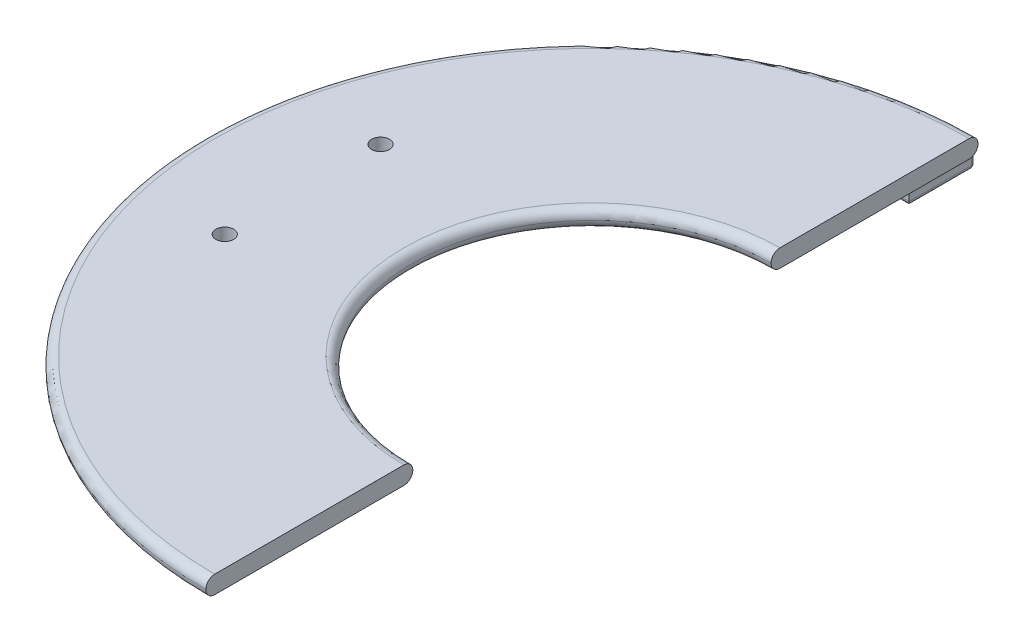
ISO-10303-21;
HEADER;
FILE_DESCRIPTION(('STEP AP214'),'2;1');
FILE_NAME('part.step','',(''),(''),'','','');
FILE_SCHEMA(('AUTOMOTIVE_DESIGN { 1 0 10303 214 1 1 1 1 }'));
ENDSEC;
DATA;
#1=APPLICATION_CONTEXT('core data for automotive mechanical design processes');
#2=APPLICATION_PROTOCOL_DEFINITION('international standard','automotive_design',2000,#1);
#3=PRODUCT_CONTEXT('',#1,'mechanical');
#4=PRODUCT('Part','Part','',(#3));
#5=PRODUCT_RELATED_PRODUCT_CATEGORY('part','',(#4));
#6=PRODUCT_DEFINITION_FORMATION('','',#4);
#7=PRODUCT_DEFINITION_CONTEXT('part definition',#1,'design');
#8=PRODUCT_DEFINITION('design','',#6,#7);
#9=PRODUCT_DEFINITION_SHAPE('','',#8);
#10=(LENGTH_UNIT() NAMED_UNIT(*) SI_UNIT(.MILLI.,.METRE.));
#11=(NAMED_UNIT(*) PLANE_ANGLE_UNIT() SI_UNIT($,.RADIAN.));
#12=(NAMED_UNIT(*) SI_UNIT($,.STERADIAN.) SOLID_ANGLE_UNIT());
#13=UNCERTAINTY_MEASURE_WITH_UNIT(LENGTH_MEASURE(1.E-05),#10,'distance_accuracy_value','');
#14=(GEOMETRIC_REPRESENTATION_CONTEXT(3) GLOBAL_UNCERTAINTY_ASSIGNED_CONTEXT((#13)) GLOBAL_UNIT_ASSIGNED_CONTEXT((#10,
#11,#12)) REPRESENTATION_CONTEXT('',''));
#15=CARTESIAN_POINT('',(0.,0.,0.));
#16=DIRECTION('',(0.,0.,1.));
#17=DIRECTION('',(1.,0.,0.));
#18=AXIS2_PLACEMENT_3D('',#15,#16,#17);
#19=CARTESIAN_POINT('',(-2.49999999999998,-5.,-83.75));
#20=DIRECTION('',(0.,0.,1.));
#21=DIRECTION('',(1.,0.,0.));
#22=AXIS2_PLACEMENT_3D('',#19,#20,#21);
#23=PLANE('',#22);
#24=DIRECTION('',(1.,0.,0.));
#25=VECTOR('',#24,1.);
#26=CARTESIAN_POINT('',(-2.49999999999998,-1.5,-83.75));
#27=LINE('',#26,#25);
#28=CARTESIAN_POINT('',(-13.5,-1.5,-83.75));
#29=VERTEX_POINT('',#28);
#30=CARTESIAN_POINT('',(-3.49999999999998,-1.5,-83.75));
#31=VERTEX_POINT('',#30);
#32=EDGE_CURVE('E188',#29,#31,#27,.T.);
#33=ORIENTED_EDGE('',*,*,#32,.F.);
#34=CARTESIAN_POINT('',(-13.5,-2.5,-83.75));
#35=DIRECTION('',(0.,0.,1.));
#36=DIRECTION('',(1.,0.,0.));
#37=AXIS2_PLACEMENT_3D('',#34,#35,#36);
#38=CIRCLE('',#37,1.);
#39=CARTESIAN_POINT('',(-14.5,-2.5,-83.75));
#40=VERTEX_POINT('',#39);
#41=EDGE_CURVE('E255',#29,#40,#38,.T.);
#42=ORIENTED_EDGE('',*,*,#41,.T.);
#43=DIRECTION('',(0.,1.,0.));
#44=VECTOR('',#43,1.);
#45=CARTESIAN_POINT('',(-14.5,-5.,-83.75));
#46=LINE('',#45,#44);
#47=CARTESIAN_POINT('',(-14.5,0.0151811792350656,-83.75));
#48=VERTEX_POINT('',#47);
#49=EDGE_CURVE('E49',#40,#48,#46,.T.);
#50=ORIENTED_EDGE('',*,*,#49,.T.);
#51=CARTESIAN_POINT('',(-14.5,0.0151811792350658,-83.75));
#52=CARTESIAN_POINT('',(-14.3734136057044,0.0125058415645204,-83.75));
#53=CARTESIAN_POINT('',(-14.2468193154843,0.0102207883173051,-83.75));
#54=CARTESIAN_POINT('',(-13.9936232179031,0.00637405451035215,-83.75));
#55=CARTESIAN_POINT('',(-13.8670214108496,0.00481235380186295,-83.75));
#56=CARTESIAN_POINT('',(-13.6138120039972,0.0023549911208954,-83.75));
#57=CARTESIAN_POINT('',(-13.4872044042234,0.00145932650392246,-83.75));
#58=CARTESIAN_POINT('',(-13.2339827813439,0.000282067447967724,-83.75));
#59=CARTESIAN_POINT('',(-13.1073687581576,4.90112956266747E-07,-83.75));
#60=CARTESIAN_POINT('',(-12.9807549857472,0.,-83.75));
#61=B_SPLINE_CURVE_WITH_KNOTS('',3,(#51,#52,#53,#54,#55,#56,#57,#58,#59,#60),.UNSPECIFIED.,.F.,
.F.,(4,2,2,2,4),(0.,0.379842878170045,0.759675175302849,1.13950596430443,1.51934733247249),.UNSPECIFIED.);
#62=CARTESIAN_POINT('',(-12.9807549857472,0.,-83.75));
#63=VERTEX_POINT('',#62);
#64=EDGE_CURVE('E11',#48,#63,#61,.T.);
#65=ORIENTED_EDGE('',*,*,#64,.T.);
#66=DIRECTION('',(1.,0.,0.));
#67=VECTOR('',#66,1.);
#68=CARTESIAN_POINT('',(-2.49999999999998,0.,-83.75));
#69=LINE('',#68,#67);
#70=CARTESIAN_POINT('',(-2.49999999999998,0.,-83.75));
#71=VERTEX_POINT('',#70);
#72=EDGE_CURVE('E163',#63,#71,#69,.T.);
#73=ORIENTED_EDGE('',*,*,#72,.T.);
#74=DIRECTION('',(0.,1.,0.));
#75=VECTOR('',#74,1.);
#76=CARTESIAN_POINT('',(-2.49999999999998,-5.,-83.75));
#77=LINE('',#76,#75);
#78=CARTESIAN_POINT('',(-2.49999999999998,-2.5,-83.75));
#79=VERTEX_POINT('',#78);
#80=EDGE_CURVE('E166',#79,#71,#77,.T.);
#81=ORIENTED_EDGE('',*,*,#80,.F.);
#82=CARTESIAN_POINT('',(-3.49999999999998,-2.5,-83.75));
#83=DIRECTION('',(0.,0.,1.));
#84=DIRECTION('',(1.,0.,0.));
#85=AXIS2_PLACEMENT_3D('',#82,#83,#84);
#86=CIRCLE('',#85,1.);
#87=EDGE_CURVE('E253',#79,#31,#86,.T.);
#88=ORIENTED_EDGE('',*,*,#87,.T.);
#89=EDGE_LOOP('',(#33,#42,#50,#65,#73,#81,#88));
#90=FACE_BOUND('',#89,.T.);
#91=ADVANCED_FACE('F33',(#90),#23,.F.);
#92=CARTESIAN_POINT('',(0.,0.,0.));
#93=DIRECTION('',(0.,1.,0.));
#94=DIRECTION('',(0.,0.,1.));
#95=AXIS2_PLACEMENT_3D('',#92,#93,#94);
#96=PLANE('',#95);
#97=CARTESIAN_POINT('',(-65.,0.,17.5));
#98=DIRECTION('',(0.,1.,0.));
#99=DIRECTION('',(0.,0.,1.));
#100=AXIS2_PLACEMENT_3D('',#97,#98,#99);
#101=CIRCLE('',#100,2.);
#102=CARTESIAN_POINT('',(-65.,0.,19.5));
#103=VERTEX_POINT('',#102);
#104=EDGE_CURVE('E37',#103,#103,#101,.T.);
#105=ORIENTED_EDGE('',*,*,#104,.T.);
#106=EDGE_LOOP('',(#105));
#107=FACE_BOUND('',#106,.T.);
#108=CARTESIAN_POINT('',(-65.,0.,-17.5));
#109=DIRECTION('',(0.,1.,0.));
#110=DIRECTION('',(0.,0.,1.));
#111=AXIS2_PLACEMENT_3D('',#108,#109,#110);
#112=CIRCLE('',#111,2.);
#113=CARTESIAN_POINT('',(-65.,0.,-15.5));
#114=VERTEX_POINT('',#113);
#115=EDGE_CURVE('E458',#114,#114,#112,.T.);
#116=ORIENTED_EDGE('',*,*,#115,.T.);
#117=EDGE_LOOP('',(#116));
#118=FACE_BOUND('',#117,.T.);
#119=DIRECTION('',(0.,0.,-1.));
#120=VECTOR('',#119,1.);
#121=CARTESIAN_POINT('',(0.,0.,-86.75));
#122=LINE('',#121,#120);
#123=CARTESIAN_POINT('',(0.,0.,-42.25));
#124=VERTEX_POINT('',#123);
#125=CARTESIAN_POINT('',(0.,0.,-84.75));
#126=VERTEX_POINT('',#125);
#127=EDGE_CURVE('E203',#124,#126,#122,.T.);
#128=ORIENTED_EDGE('',*,*,#127,.F.);
#129=CARTESIAN_POINT('',(0.,0.,0.));
#130=DIRECTION('',(0.,1.,0.));
#131=DIRECTION('',(0.,0.,1.));
#132=AXIS2_PLACEMENT_3D('',#129,#130,#131);
#133=CIRCLE('',#132,42.25);
#134=CARTESIAN_POINT('',(0.,0.,42.25));
#135=VERTEX_POINT('',#134);
#136=EDGE_CURVE('E321',#124,#135,#133,.T.);
#137=ORIENTED_EDGE('',*,*,#136,.T.);
#138=DIRECTION('',(0.,0.,-1.));
#139=VECTOR('',#138,1.);
#140=CARTESIAN_POINT('',(0.,0.,40.25));
#141=LINE('',#140,#139);
#142=CARTESIAN_POINT('',(0.,0.,84.75));
#143=VERTEX_POINT('',#142);
#144=EDGE_CURVE('E208',#143,#135,#141,.T.);
#145=ORIENTED_EDGE('',*,*,#144,.F.);
#146=CARTESIAN_POINT('',(0.,0.,0.));
#147=DIRECTION('',(0.,1.,0.));
#148=DIRECTION('',(0.,0.,1.));
#149=AXIS2_PLACEMENT_3D('',#146,#147,#148);
#150=CIRCLE('',#149,84.75);
#151=CARTESIAN_POINT('',(-14.5,0.,-83.5003742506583));
#152=VERTEX_POINT('',#151);
#153=EDGE_CURVE('E319',#143,#152,#150,.F.);
#154=ORIENTED_EDGE('',*,*,#153,.T.);
#155=DIRECTION('',(0.,0.,-1.));
#156=VECTOR('',#155,1.);
#157=CARTESIAN_POINT('',(-14.5,0.,-83.75));
#158=LINE('',#157,#156);
#159=CARTESIAN_POINT('',(-14.5,0.,-73.75));
#160=VERTEX_POINT('',#159);
#161=EDGE_CURVE('E171',#160,#152,#158,.T.);
#162=ORIENTED_EDGE('',*,*,#161,.F.);
#163=DIRECTION('',(-1.,0.,0.));
#164=VECTOR('',#163,1.);
#165=CARTESIAN_POINT('',(-2.49999999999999,0.,-73.75));
#166=LINE('',#165,#164);
#167=CARTESIAN_POINT('',(-2.49999999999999,0.,-73.75));
#168=VERTEX_POINT('',#167);
#169=EDGE_CURVE('E187',#168,#160,#166,.T.);
#170=ORIENTED_EDGE('',*,*,#169,.F.);
#171=DIRECTION('',(0.,0.,1.));
#172=VECTOR('',#171,1.);
#173=CARTESIAN_POINT('',(-2.49999999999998,0.,-83.75));
#174=LINE('',#173,#172);
#175=EDGE_CURVE('E177',#71,#168,#174,.T.);
#176=ORIENTED_EDGE('',*,*,#175,.F.);
#177=ORIENTED_EDGE('',*,*,#72,.F.);
#178=CARTESIAN_POINT('',(0.,0.,0.));
#179=DIRECTION('',(0.,1.,0.));
#180=DIRECTION('',(0.,0.,1.));
#181=AXIS2_PLACEMENT_3D('',#178,#179,#180);
#182=CIRCLE('',#181,84.75);
#183=EDGE_CURVE('E317',#63,#126,#182,.F.);
#184=ORIENTED_EDGE('',*,*,#183,.T.);
#185=EDGE_LOOP('',(#128,#137,#145,#154,#162,#170,#176,#177,#184));
#186=FACE_BOUND('',#185,.T.);
#187=ADVANCED_FACE('F184',(#107,#118,#186),#96,.F.);
#188=CARTESIAN_POINT('',(0.,4.,-86.75));
#189=DIRECTION('',(-1.,0.,0.));
#190=DIRECTION('',(0.,0.,1.));
#191=AXIS2_PLACEMENT_3D('',#188,#189,#190);
#192=PLANE('',#191);
#193=DIRECTION('',(0.,0.,-1.));
#194=VECTOR('',#193,1.);
#195=CARTESIAN_POINT('',(0.,4.,-86.75));
#196=LINE('',#195,#194);
#197=CARTESIAN_POINT('',(0.,4.,-42.25));
#198=VERTEX_POINT('',#197);
#199=CARTESIAN_POINT('',(0.,4.,-84.75));
#200=VERTEX_POINT('',#199);
#201=EDGE_CURVE('E204',#198,#200,#196,.T.);
#202=ORIENTED_EDGE('',*,*,#201,.F.);
#203=CARTESIAN_POINT('',(0.,2.,-42.25));
#204=DIRECTION('',(-1.,0.,0.));
#205=DIRECTION('',(0.,0.,1.));
#206=AXIS2_PLACEMENT_3D('',#203,#204,#205);
#207=CIRCLE('',#206,2.);
#208=CARTESIAN_POINT('',(0.,2.,-40.25));
#209=VERTEX_POINT('',#208);
#210=EDGE_CURVE('E307',#198,#209,#207,.F.);
#211=ORIENTED_EDGE('',*,*,#210,.T.);
#212=CARTESIAN_POINT('',(0.,2.,-42.25));
#213=DIRECTION('',(-1.,0.,0.));
#214=DIRECTION('',(0.,0.,1.));
#215=AXIS2_PLACEMENT_3D('',#212,#213,#214);
#216=CIRCLE('',#215,2.);
#217=EDGE_CURVE('E305',#209,#124,#216,.F.);
#218=ORIENTED_EDGE('',*,*,#217,.T.);
#219=ORIENTED_EDGE('',*,*,#127,.T.);
#220=CARTESIAN_POINT('',(0.,2.,-84.75));
#221=DIRECTION('',(-1.,0.,0.));
#222=DIRECTION('',(0.,0.,1.));
#223=AXIS2_PLACEMENT_3D('',#220,#221,#222);
#224=CIRCLE('',#223,2.);
#225=CARTESIAN_POINT('',(0.,2.,-86.75));
#226=VERTEX_POINT('',#225);
#227=EDGE_CURVE('E303',#126,#226,#224,.F.);
#228=ORIENTED_EDGE('',*,*,#227,.T.);
#229=CARTESIAN_POINT('',(0.,2.,-84.75));
#230=DIRECTION('',(-1.,0.,0.));
#231=DIRECTION('',(0.,0.,1.));
#232=AXIS2_PLACEMENT_3D('',#229,#230,#231);
#233=CIRCLE('',#232,2.);
#234=EDGE_CURVE('E301',#226,#200,#233,.F.);
#235=ORIENTED_EDGE('',*,*,#234,.T.);
#236=EDGE_LOOP('',(#202,#211,#218,#219,#228,#235));
#237=FACE_BOUND('',#236,.T.);
#238=ADVANCED_FACE('F402',(#237),#192,.F.);
#239=CARTESIAN_POINT('',(0.,4.,40.25));
#240=DIRECTION('',(-1.,0.,0.));
#241=DIRECTION('',(0.,0.,1.));
#242=AXIS2_PLACEMENT_3D('',#239,#240,#241);
#243=PLANE('',#242);
#244=CARTESIAN_POINT('',(0.,2.,42.25));
#245=DIRECTION('',(-1.,0.,0.));
#246=DIRECTION('',(0.,0.,1.));
#247=AXIS2_PLACEMENT_3D('',#244,#245,#246);
#248=CIRCLE('',#247,2.);
#249=CARTESIAN_POINT('',(0.,2.,40.25));
#250=VERTEX_POINT('',#249);
#251=EDGE_CURVE('E313',#135,#250,#248,.F.);
#252=ORIENTED_EDGE('',*,*,#251,.T.);
#253=CARTESIAN_POINT('',(0.,2.,42.25));
#254=DIRECTION('',(-1.,0.,0.));
#255=DIRECTION('',(0.,0.,1.));
#256=AXIS2_PLACEMENT_3D('',#253,#254,#255);
#257=CIRCLE('',#256,2.);
#258=CARTESIAN_POINT('',(0.,4.,42.25));
#259=VERTEX_POINT('',#258);
#260=EDGE_CURVE('E315',#250,#259,#257,.F.);
#261=ORIENTED_EDGE('',*,*,#260,.T.);
#262=DIRECTION('',(0.,0.,-1.));
#263=VECTOR('',#262,1.);
#264=CARTESIAN_POINT('',(0.,4.,40.25));
#265=LINE('',#264,#263);
#266=CARTESIAN_POINT('',(0.,4.,84.75));
#267=VERTEX_POINT('',#266);
#268=EDGE_CURVE('E207',#267,#259,#265,.T.);
#269=ORIENTED_EDGE('',*,*,#268,.F.);
#270=CARTESIAN_POINT('',(0.,2.,84.75));
#271=DIRECTION('',(-1.,0.,0.));
#272=DIRECTION('',(0.,0.,1.));
#273=AXIS2_PLACEMENT_3D('',#270,#271,#272);
#274=CIRCLE('',#273,2.);
#275=CARTESIAN_POINT('',(0.,2.,86.75));
#276=VERTEX_POINT('',#275);
#277=EDGE_CURVE('E309',#267,#276,#274,.F.);
#278=ORIENTED_EDGE('',*,*,#277,.T.);
#279=CARTESIAN_POINT('',(0.,2.,84.75));
#280=DIRECTION('',(-1.,0.,0.));
#281=DIRECTION('',(0.,0.,1.));
#282=AXIS2_PLACEMENT_3D('',#279,#280,#281);
#283=CIRCLE('',#282,2.);
#284=EDGE_CURVE('E311',#276,#143,#283,.F.);
#285=ORIENTED_EDGE('',*,*,#284,.T.);
#286=ORIENTED_EDGE('',*,*,#144,.T.);
#287=EDGE_LOOP('',(#252,#261,#269,#278,#285,#286));
#288=FACE_BOUND('',#287,.T.);
#289=ADVANCED_FACE('F405',(#288),#243,.F.);
#290=CARTESIAN_POINT('',(0.,4.,0.));
#291=DIRECTION('',(0.,1.,0.));
#292=DIRECTION('',(0.,0.,1.));
#293=AXIS2_PLACEMENT_3D('',#290,#291,#292);
#294=PLANE('',#293);
#295=CARTESIAN_POINT('',(-65.,4.,17.5));
#296=DIRECTION('',(0.,1.,0.));
#297=DIRECTION('',(0.,0.,1.));
#298=AXIS2_PLACEMENT_3D('',#295,#296,#297);
#299=CIRCLE('',#298,2.);
#300=CARTESIAN_POINT('',(-65.,4.,19.5));
#301=VERTEX_POINT('',#300);
#302=EDGE_CURVE('E453',#301,#301,#299,.T.);
#303=ORIENTED_EDGE('',*,*,#302,.F.);
#304=EDGE_LOOP('',(#303));
#305=FACE_BOUND('',#304,.T.);
#306=CARTESIAN_POINT('',(-65.,4.,-17.5));
#307=DIRECTION('',(0.,1.,0.));
#308=DIRECTION('',(0.,0.,1.));
#309=AXIS2_PLACEMENT_3D('',#306,#307,#308);
#310=CIRCLE('',#309,2.);
#311=CARTESIAN_POINT('',(-65.,4.,-15.5));
#312=VERTEX_POINT('',#311);
#313=EDGE_CURVE('E456',#312,#312,#310,.T.);
#314=ORIENTED_EDGE('',*,*,#313,.F.);
#315=EDGE_LOOP('',(#314));
#316=FACE_BOUND('',#315,.T.);
#317=ORIENTED_EDGE('',*,*,#268,.T.);
#318=CARTESIAN_POINT('',(0.,4.,0.));
#319=DIRECTION('',(0.,1.,0.));
#320=DIRECTION('',(0.,0.,1.));
#321=AXIS2_PLACEMENT_3D('',#318,#319,#320);
#322=CIRCLE('',#321,42.25);
#323=EDGE_CURVE('E298',#259,#198,#322,.F.);
#324=ORIENTED_EDGE('',*,*,#323,.T.);
#325=ORIENTED_EDGE('',*,*,#201,.T.);
#326=CARTESIAN_POINT('',(0.,4.,0.));
#327=DIRECTION('',(0.,1.,0.));
#328=DIRECTION('',(0.,0.,1.));
#329=AXIS2_PLACEMENT_3D('',#326,#327,#328);
#330=CIRCLE('',#329,84.75);
#331=EDGE_CURVE('E257',#200,#267,#330,.T.);
#332=ORIENTED_EDGE('',*,*,#331,.T.);
#333=EDGE_LOOP('',(#317,#324,#325,#332));
#334=FACE_BOUND('',#333,.T.);
#335=ADVANCED_FACE('F409',(#305,#316,#334),#294,.T.);
#336=CARTESIAN_POINT('',(-2.49999999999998,-5.,-83.75));
#337=DIRECTION('',(-1.,0.,0.));
#338=DIRECTION('',(0.,0.,1.));
#339=AXIS2_PLACEMENT_3D('',#336,#337,#338);
#340=PLANE('',#339);
#341=DIRECTION('',(0.,0.,1.));
#342=VECTOR('',#341,1.);
#343=CARTESIAN_POINT('',(-2.49999999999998,-2.5,-83.75));
#344=LINE('',#343,#342);
#345=CARTESIAN_POINT('',(-2.49999999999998,-2.5,-87.75));
#346=VERTEX_POINT('',#345);
#347=EDGE_CURVE('E179',#346,#79,#344,.T.);
#348=ORIENTED_EDGE('',*,*,#347,.T.);
#349=ORIENTED_EDGE('',*,*,#80,.T.);
#350=ORIENTED_EDGE('',*,*,#175,.T.);
#351=DIRECTION('',(0.,1.,0.));
#352=VECTOR('',#351,1.);
#353=CARTESIAN_POINT('',(-2.49999999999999,-5.,-73.75));
#354=LINE('',#353,#352);
#355=CARTESIAN_POINT('',(-2.49999999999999,-4.,-73.75));
#356=VERTEX_POINT('',#355);
#357=EDGE_CURVE('E201',#356,#168,#354,.T.);
#358=ORIENTED_EDGE('',*,*,#357,.F.);
#359=DIRECTION('',(0.,0.,1.));
#360=VECTOR('',#359,1.);
#361=CARTESIAN_POINT('',(-2.49999999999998,-4.,-88.75));
#362=LINE('',#361,#360);
#363=CARTESIAN_POINT('',(-2.49999999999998,-4.,-87.75));
#364=VERTEX_POINT('',#363);
#365=EDGE_CURVE('E227',#356,#364,#362,.F.);
#366=ORIENTED_EDGE('',*,*,#365,.T.);
#367=DIRECTION('',(0.,-1.,0.));
#368=VECTOR('',#367,1.);
#369=CARTESIAN_POINT('',(-2.49999999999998,-5.,-87.75));
#370=LINE('',#369,#368);
#371=EDGE_CURVE('E224',#364,#346,#370,.F.);
#372=ORIENTED_EDGE('',*,*,#371,.T.);
#373=EDGE_LOOP('',(#348,#349,#350,#358,#366,#372));
#374=FACE_BOUND('',#373,.T.);
#375=ADVANCED_FACE('F175',(#374),#340,.F.);
#376=CARTESIAN_POINT('',(-2.49999999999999,-5.,-73.75));
#377=DIRECTION('',(0.,0.,-1.));
#378=DIRECTION('',(-1.,0.,0.));
#379=AXIS2_PLACEMENT_3D('',#376,#377,#378);
#380=PLANE('',#379);
#381=DIRECTION('',(0.,1.,0.));
#382=VECTOR('',#381,1.);
#383=CARTESIAN_POINT('',(-14.5,-5.,-73.75));
#384=LINE('',#383,#382);
#385=CARTESIAN_POINT('',(-14.5,-4.,-73.75));
#386=VERTEX_POINT('',#385);
#387=EDGE_CURVE('E199',#386,#160,#384,.T.);
#388=ORIENTED_EDGE('',*,*,#387,.F.);
#389=DIRECTION('',(-1.,0.,0.));
#390=VECTOR('',#389,1.);
#391=CARTESIAN_POINT('',(-2.49999999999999,-4.,-73.75));
#392=LINE('',#391,#390);
#393=EDGE_CURVE('E242',#386,#356,#392,.F.);
#394=ORIENTED_EDGE('',*,*,#393,.T.);
#395=ORIENTED_EDGE('',*,*,#357,.T.);
#396=ORIENTED_EDGE('',*,*,#169,.T.);
#397=EDGE_LOOP('',(#388,#394,#395,#396));
#398=FACE_BOUND('',#397,.T.);
#399=ADVANCED_FACE('F418',(#398),#380,.F.);
#400=CARTESIAN_POINT('',(-14.5,-5.,-83.75));
#401=DIRECTION('',(1.,0.,0.));
#402=DIRECTION('',(0.,0.,-1.));
#403=AXIS2_PLACEMENT_3D('',#400,#401,#402);
#404=PLANE('',#403);
#405=DIRECTION('',(0.,1.,0.));
#406=VECTOR('',#405,1.);
#407=CARTESIAN_POINT('',(-14.5,-5.,-87.75));
#408=LINE('',#407,#406);
#409=CARTESIAN_POINT('',(-14.5,-2.5,-87.75));
#410=VERTEX_POINT('',#409);
#411=CARTESIAN_POINT('',(-14.5,-4.,-87.75));
#412=VERTEX_POINT('',#411);
#413=EDGE_CURVE('E230',#410,#412,#408,.F.);
#414=ORIENTED_EDGE('',*,*,#413,.T.);
#415=DIRECTION('',(0.,0.,-1.));
#416=VECTOR('',#415,1.);
#417=CARTESIAN_POINT('',(-14.5,-4.,-73.75));
#418=LINE('',#417,#416);
#419=EDGE_CURVE('E234',#412,#386,#418,.F.);
#420=ORIENTED_EDGE('',*,*,#419,.T.);
#421=ORIENTED_EDGE('',*,*,#387,.T.);
#422=ORIENTED_EDGE('',*,*,#161,.T.);
#423=CARTESIAN_POINT('',(-14.5,0.,-83.5003742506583));
#424=CARTESIAN_POINT('',(-14.5,2.01541857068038E-06,-83.5421322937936));
#425=CARTESIAN_POINT('',(-14.5,0.0012681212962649,-83.5838134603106));
#426=CARTESIAN_POINT('',(-14.5,0.00632851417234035,-83.6670220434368));
#427=CARTESIAN_POINT('',(-14.5,0.0101228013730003,-83.7085494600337));
#428=CARTESIAN_POINT('',(-14.5,0.0151811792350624,-83.75));
#429=B_SPLINE_CURVE_WITH_KNOTS('',3,(#423,#424,#425,#426,#427,#428),.UNSPECIFIED.,.F.,.F.,(4,2,
4),(0.,0.125101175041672,0.250202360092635),.UNSPECIFIED.);
#430=EDGE_CURVE('E42',#152,#48,#429,.T.);
#431=ORIENTED_EDGE('',*,*,#430,.T.);
#432=ORIENTED_EDGE('',*,*,#49,.F.);
#433=DIRECTION('',(0.,0.,1.));
#434=VECTOR('',#433,1.);
#435=CARTESIAN_POINT('',(-14.5,-2.5,-83.75));
#436=LINE('',#435,#434);
#437=EDGE_CURVE('E232',#40,#410,#436,.F.);
#438=ORIENTED_EDGE('',*,*,#437,.T.);
#439=EDGE_LOOP('',(#414,#420,#421,#422,#431,#432,#438));
#440=FACE_BOUND('',#439,.T.);
#441=ADVANCED_FACE('F332',(#440),#404,.F.);
#442=CARTESIAN_POINT('',(0.,-5.,0.));
#443=DIRECTION('',(0.,-1.,0.));
#444=DIRECTION('',(0.,0.,-1.));
#445=AXIS2_PLACEMENT_3D('',#442,#443,#444);
#446=PLANE('',#445);
#447=DIRECTION('',(0.,0.,1.));
#448=VECTOR('',#447,1.);
#449=CARTESIAN_POINT('',(-3.49999999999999,-5.,-73.75));
#450=LINE('',#449,#448);
#451=CARTESIAN_POINT('',(-3.49999999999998,-5.,-87.75));
#452=VERTEX_POINT('',#451);
#453=CARTESIAN_POINT('',(-3.49999999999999,-5.,-74.75));
#454=VERTEX_POINT('',#453);
#455=EDGE_CURVE('E219',#452,#454,#450,.T.);
#456=ORIENTED_EDGE('',*,*,#455,.T.);
#457=DIRECTION('',(-1.,0.,0.));
#458=VECTOR('',#457,1.);
#459=CARTESIAN_POINT('',(-14.5,-5.,-74.75));
#460=LINE('',#459,#458);
#461=CARTESIAN_POINT('',(-13.5,-5.,-74.75));
#462=VERTEX_POINT('',#461);
#463=EDGE_CURVE('E222',#454,#462,#460,.T.);
#464=ORIENTED_EDGE('',*,*,#463,.T.);
#465=DIRECTION('',(0.,0.,-1.));
#466=VECTOR('',#465,1.);
#467=CARTESIAN_POINT('',(-13.5,-5.,-88.75));
#468=LINE('',#467,#466);
#469=CARTESIAN_POINT('',(-13.5,-5.,-87.75));
#470=VERTEX_POINT('',#469);
#471=EDGE_CURVE('E217',#462,#470,#468,.T.);
#472=ORIENTED_EDGE('',*,*,#471,.T.);
#473=DIRECTION('',(-1.,0.,0.));
#474=VECTOR('',#473,1.);
#475=CARTESIAN_POINT('',(-2.49999999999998,-5.,-87.75));
#476=LINE('',#475,#474);
#477=EDGE_CURVE('E211',#470,#452,#476,.F.);
#478=ORIENTED_EDGE('',*,*,#477,.T.);
#479=EDGE_LOOP('',(#456,#464,#472,#478));
#480=FACE_BOUND('',#479,.T.);
#481=ADVANCED_FACE('F424',(#480),#446,.T.);
#482=CARTESIAN_POINT('',(-2.49999999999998,-1.5,-88.75));
#483=DIRECTION('',(0.,-1.,0.));
#484=DIRECTION('',(0.,0.,-1.));
#485=AXIS2_PLACEMENT_3D('',#482,#483,#484);
#486=PLANE('',#485);
#487=ORIENTED_EDGE('',*,*,#32,.T.);
#488=DIRECTION('',(0.,0.,1.));
#489=VECTOR('',#488,1.);
#490=CARTESIAN_POINT('',(-3.49999999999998,-1.5,-88.75));
#491=LINE('',#490,#489);
#492=CARTESIAN_POINT('',(-3.49999999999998,-1.5,-87.75));
#493=VERTEX_POINT('',#492);
#494=EDGE_CURVE('E240',#31,#493,#491,.F.);
#495=ORIENTED_EDGE('',*,*,#494,.T.);
#496=DIRECTION('',(1.,0.,0.));
#497=VECTOR('',#496,1.);
#498=CARTESIAN_POINT('',(-2.49999999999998,-1.5,-87.75));
#499=LINE('',#498,#497);
#500=CARTESIAN_POINT('',(-13.5,-1.5,-87.75));
#501=VERTEX_POINT('',#500);
#502=EDGE_CURVE('E236',#493,#501,#499,.F.);
#503=ORIENTED_EDGE('',*,*,#502,.T.);
#504=DIRECTION('',(0.,0.,1.));
#505=VECTOR('',#504,1.);
#506=CARTESIAN_POINT('',(-13.5,-1.5,-88.75));
#507=LINE('',#506,#505);
#508=EDGE_CURVE('E238',#501,#29,#507,.T.);
#509=ORIENTED_EDGE('',*,*,#508,.T.);
#510=EDGE_LOOP('',(#487,#495,#503,#509));
#511=FACE_BOUND('',#510,.T.);
#512=ADVANCED_FACE('F434',(#511),#486,.F.);
#513=CARTESIAN_POINT('',(0.,0.,-88.75));
#514=DIRECTION('',(0.,0.,1.));
#515=DIRECTION('',(1.,0.,0.));
#516=AXIS2_PLACEMENT_3D('',#513,#514,#515);
#517=PLANE('',#516);
#518=DIRECTION('',(1.,0.,0.));
#519=VECTOR('',#518,1.);
#520=CARTESIAN_POINT('',(0.,-2.5,-88.75));
#521=LINE('',#520,#519);
#522=CARTESIAN_POINT('',(-13.5,-2.5,-88.75));
#523=VERTEX_POINT('',#522);
#524=CARTESIAN_POINT('',(-3.49999999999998,-2.5,-88.75));
#525=VERTEX_POINT('',#524);
#526=EDGE_CURVE('E246',#523,#525,#521,.T.);
#527=ORIENTED_EDGE('',*,*,#526,.T.);
#528=DIRECTION('',(0.,-1.,0.));
#529=VECTOR('',#528,1.);
#530=CARTESIAN_POINT('',(-3.49999999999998,0.,-88.75));
#531=LINE('',#530,#529);
#532=CARTESIAN_POINT('',(-3.49999999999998,-4.,-88.75));
#533=VERTEX_POINT('',#532);
#534=EDGE_CURVE('E251',#525,#533,#531,.T.);
#535=ORIENTED_EDGE('',*,*,#534,.T.);
#536=DIRECTION('',(-1.,0.,0.));
#537=VECTOR('',#536,1.);
#538=CARTESIAN_POINT('',(-14.5,-4.,-88.75));
#539=LINE('',#538,#537);
#540=CARTESIAN_POINT('',(-13.5,-4.,-88.75));
#541=VERTEX_POINT('',#540);
#542=EDGE_CURVE('E248',#533,#541,#539,.T.);
#543=ORIENTED_EDGE('',*,*,#542,.T.);
#544=DIRECTION('',(0.,1.,0.));
#545=VECTOR('',#544,1.);
#546=CARTESIAN_POINT('',(-13.5,0.,-88.75));
#547=LINE('',#546,#545);
#548=EDGE_CURVE('E244',#541,#523,#547,.T.);
#549=ORIENTED_EDGE('',*,*,#548,.T.);
#550=EDGE_LOOP('',(#527,#535,#543,#549));
#551=FACE_BOUND('',#550,.T.);
#552=ADVANCED_FACE('F354',(#551),#517,.F.);
#553=CARTESIAN_POINT('',(-13.5,-2.5,-88.75));
#554=DIRECTION('',(0.,0.,1.));
#555=DIRECTION('',(1.,0.,0.));
#556=AXIS2_PLACEMENT_3D('',#553,#554,#555);
#557=CYLINDRICAL_SURFACE('',#556,1.);
#558=CARTESIAN_POINT('',(-13.5,-2.5,-87.75));
#559=DIRECTION('',(0.,0.,-1.));
#560=DIRECTION('',(-1.,0.,0.));
#561=AXIS2_PLACEMENT_3D('',#558,#559,#560);
#562=CIRCLE('',#561,1.);
#563=EDGE_CURVE('E192',#410,#501,#562,.T.);
#564=ORIENTED_EDGE('',*,*,#563,.F.);
#565=ORIENTED_EDGE('',*,*,#437,.F.);
#566=ORIENTED_EDGE('',*,*,#41,.F.);
#567=ORIENTED_EDGE('',*,*,#508,.F.);
#568=EDGE_LOOP('',(#564,#565,#566,#567));
#569=FACE_BOUND('',#568,.T.);
#570=ADVANCED_FACE('F350',(#569),#557,.T.);
#571=CARTESIAN_POINT('',(-13.5,-2.5,-87.75));
#572=DIRECTION('',(0.,0.,1.));
#573=DIRECTION('',(1.,0.,0.));
#574=AXIS2_PLACEMENT_3D('',#571,#572,#573);
#575=SPHERICAL_SURFACE('',#574,1.);
#576=CARTESIAN_POINT('',(-13.5,-2.5,-87.75));
#577=DIRECTION('',(0.,1.,0.));
#578=DIRECTION('',(0.,0.,1.));
#579=AXIS2_PLACEMENT_3D('',#576,#577,#578);
#580=CIRCLE('',#579,1.);
#581=EDGE_CURVE('E289',#410,#523,#580,.F.);
#582=ORIENTED_EDGE('',*,*,#581,.F.);
#583=ORIENTED_EDGE('',*,*,#563,.T.);
#584=CARTESIAN_POINT('',(-13.5,-2.5,-87.75));
#585=DIRECTION('',(-1.,0.,0.));
#586=DIRECTION('',(0.,0.,1.));
#587=AXIS2_PLACEMENT_3D('',#584,#585,#586);
#588=CIRCLE('',#587,1.);
#589=EDGE_CURVE('E292',#523,#501,#588,.F.);
#590=ORIENTED_EDGE('',*,*,#589,.F.);
#591=EDGE_LOOP('',(#582,#583,#590));
#592=FACE_BOUND('',#591,.T.);
#593=ADVANCED_FACE('F353',(#592),#575,.T.);
#594=CARTESIAN_POINT('',(-3.49999999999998,-2.5,-83.75));
#595=DIRECTION('',(0.,0.,1.));
#596=DIRECTION('',(1.,0.,0.));
#597=AXIS2_PLACEMENT_3D('',#594,#595,#596);
#598=CYLINDRICAL_SURFACE('',#597,1.);
#599=ORIENTED_EDGE('',*,*,#87,.F.);
#600=ORIENTED_EDGE('',*,*,#347,.F.);
#601=CARTESIAN_POINT('',(-3.49999999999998,-2.5,-87.75));
#602=DIRECTION('',(0.,0.,-1.));
#603=DIRECTION('',(-1.,0.,0.));
#604=AXIS2_PLACEMENT_3D('',#601,#602,#603);
#605=CIRCLE('',#604,1.);
#606=EDGE_CURVE('E286',#493,#346,#605,.T.);
#607=ORIENTED_EDGE('',*,*,#606,.F.);
#608=ORIENTED_EDGE('',*,*,#494,.F.);
#609=EDGE_LOOP('',(#599,#600,#607,#608));
#610=FACE_BOUND('',#609,.T.);
#611=ADVANCED_FACE('F358',(#610),#598,.T.);
#612=CARTESIAN_POINT('',(0.,-2.5,-87.75));
#613=DIRECTION('',(1.,0.,0.));
#614=DIRECTION('',(0.,0.,-1.));
#615=AXIS2_PLACEMENT_3D('',#612,#613,#614);
#616=CYLINDRICAL_SURFACE('',#615,1.);
#617=ORIENTED_EDGE('',*,*,#589,.T.);
#618=ORIENTED_EDGE('',*,*,#502,.F.);
#619=CARTESIAN_POINT('',(-3.49999999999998,-2.5,-87.75));
#620=DIRECTION('',(1.,0.,0.));
#621=DIRECTION('',(0.,0.,-1.));
#622=AXIS2_PLACEMENT_3D('',#619,#620,#621);
#623=CIRCLE('',#622,1.);
#624=EDGE_CURVE('E283',#525,#493,#623,.T.);
#625=ORIENTED_EDGE('',*,*,#624,.F.);
#626=ORIENTED_EDGE('',*,*,#526,.F.);
#627=EDGE_LOOP('',(#617,#618,#625,#626));
#628=FACE_BOUND('',#627,.T.);
#629=ADVANCED_FACE('F362',(#628),#616,.T.);
#630=CARTESIAN_POINT('',(-13.5,0.,-87.75));
#631=DIRECTION('',(0.,1.,0.));
#632=DIRECTION('',(0.,0.,1.));
#633=AXIS2_PLACEMENT_3D('',#630,#631,#632);
#634=CYLINDRICAL_SURFACE('',#633,1.);
#635=ORIENTED_EDGE('',*,*,#581,.T.);
#636=ORIENTED_EDGE('',*,*,#548,.F.);
#637=CARTESIAN_POINT('',(-13.5,-4.,-87.75));
#638=DIRECTION('',(0.,-1.,0.));
#639=DIRECTION('',(0.,0.,-1.));
#640=AXIS2_PLACEMENT_3D('',#637,#638,#639);
#641=CIRCLE('',#640,1.);
#642=EDGE_CURVE('E280',#412,#541,#641,.T.);
#643=ORIENTED_EDGE('',*,*,#642,.F.);
#644=ORIENTED_EDGE('',*,*,#413,.F.);
#645=EDGE_LOOP('',(#635,#636,#643,#644));
#646=FACE_BOUND('',#645,.T.);
#647=ADVANCED_FACE('F366',(#646),#634,.T.);
#648=CARTESIAN_POINT('',(-3.49999999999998,-2.5,-87.75));
#649=DIRECTION('',(0.,0.,1.));
#650=DIRECTION('',(1.,0.,0.));
#651=AXIS2_PLACEMENT_3D('',#648,#649,#650);
#652=SPHERICAL_SURFACE('',#651,1.);
#653=ORIENTED_EDGE('',*,*,#624,.T.);
#654=ORIENTED_EDGE('',*,*,#606,.T.);
#655=CARTESIAN_POINT('',(-3.49999999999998,-2.5,-87.75));
#656=DIRECTION('',(0.,1.,0.));
#657=DIRECTION('',(0.,0.,1.));
#658=AXIS2_PLACEMENT_3D('',#655,#656,#657);
#659=CIRCLE('',#658,1.);
#660=EDGE_CURVE('E277',#525,#346,#659,.F.);
#661=ORIENTED_EDGE('',*,*,#660,.F.);
#662=EDGE_LOOP('',(#653,#654,#661));
#663=FACE_BOUND('',#662,.T.);
#664=ADVANCED_FACE('F370',(#663),#652,.T.);
#665=CARTESIAN_POINT('',(-13.5,-4.,-87.75));
#666=DIRECTION('',(0.,0.,1.));
#667=DIRECTION('',(1.,0.,0.));
#668=AXIS2_PLACEMENT_3D('',#665,#666,#667);
#669=SPHERICAL_SURFACE('',#668,1.);
#670=CARTESIAN_POINT('',(-13.5,-4.,-87.75));
#671=DIRECTION('',(0.,0.,-1.));
#672=DIRECTION('',(-1.,0.,0.));
#673=AXIS2_PLACEMENT_3D('',#670,#671,#672);
#674=CIRCLE('',#673,1.);
#675=EDGE_CURVE('E272',#412,#470,#674,.F.);
#676=ORIENTED_EDGE('',*,*,#675,.F.);
#677=ORIENTED_EDGE('',*,*,#642,.T.);
#678=CARTESIAN_POINT('',(-13.5,-4.,-87.75));
#679=DIRECTION('',(-1.,0.,0.));
#680=DIRECTION('',(0.,0.,1.));
#681=AXIS2_PLACEMENT_3D('',#678,#679,#680);
#682=CIRCLE('',#681,1.);
#683=EDGE_CURVE('E275',#470,#541,#682,.F.);
#684=ORIENTED_EDGE('',*,*,#683,.F.);
#685=EDGE_LOOP('',(#676,#677,#684));
#686=FACE_BOUND('',#685,.T.);
#687=ADVANCED_FACE('F374',(#686),#669,.T.);
#688=CARTESIAN_POINT('',(-3.49999999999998,0.,-87.75));
#689=DIRECTION('',(0.,-1.,0.));
#690=DIRECTION('',(0.,0.,-1.));
#691=AXIS2_PLACEMENT_3D('',#688,#689,#690);
#692=CYLINDRICAL_SURFACE('',#691,1.);
#693=ORIENTED_EDGE('',*,*,#660,.T.);
#694=ORIENTED_EDGE('',*,*,#371,.F.);
#695=CARTESIAN_POINT('',(-3.49999999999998,-4.,-87.75));
#696=DIRECTION('',(0.,-1.,0.));
#697=DIRECTION('',(0.,0.,-1.));
#698=AXIS2_PLACEMENT_3D('',#695,#696,#697);
#699=CIRCLE('',#698,1.);
#700=EDGE_CURVE('E269',#533,#364,#699,.T.);
#701=ORIENTED_EDGE('',*,*,#700,.F.);
#702=ORIENTED_EDGE('',*,*,#534,.F.);
#703=EDGE_LOOP('',(#693,#694,#701,#702));
#704=FACE_BOUND('',#703,.T.);
#705=ADVANCED_FACE('F378',(#704),#692,.T.);
#706=CARTESIAN_POINT('',(0.,-4.,-87.75));
#707=DIRECTION('',(1.,0.,0.));
#708=DIRECTION('',(0.,0.,-1.));
#709=AXIS2_PLACEMENT_3D('',#706,#707,#708);
#710=CYLINDRICAL_SURFACE('',#709,1.);
#711=ORIENTED_EDGE('',*,*,#683,.T.);
#712=ORIENTED_EDGE('',*,*,#542,.F.);
#713=CARTESIAN_POINT('',(-3.49999999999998,-4.,-87.75));
#714=DIRECTION('',(1.,0.,0.));
#715=DIRECTION('',(0.,0.,-1.));
#716=AXIS2_PLACEMENT_3D('',#713,#714,#715);
#717=CIRCLE('',#716,1.);
#718=EDGE_CURVE('E266',#452,#533,#717,.T.);
#719=ORIENTED_EDGE('',*,*,#718,.F.);
#720=ORIENTED_EDGE('',*,*,#477,.F.);
#721=EDGE_LOOP('',(#711,#712,#719,#720));
#722=FACE_BOUND('',#721,.T.);
#723=ADVANCED_FACE('F382',(#722),#710,.T.);
#724=CARTESIAN_POINT('',(-13.5,-4.,0.));
#725=DIRECTION('',(0.,0.,1.));
#726=DIRECTION('',(1.,0.,0.));
#727=AXIS2_PLACEMENT_3D('',#724,#725,#726);
#728=CYLINDRICAL_SURFACE('',#727,1.);
#729=ORIENTED_EDGE('',*,*,#675,.T.);
#730=ORIENTED_EDGE('',*,*,#471,.F.);
#731=CARTESIAN_POINT('',(-13.5,-4.,-74.75));
#732=DIRECTION('',(0.707106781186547,0.,0.707106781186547));
#733=DIRECTION('',(0.707106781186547,0.,-0.707106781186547));
#734=AXIS2_PLACEMENT_3D('',#731,#732,#733);
#735=ELLIPSE('',#734,1.41421356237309,1.);
#736=EDGE_CURVE('E263',#386,#462,#735,.T.);
#737=ORIENTED_EDGE('',*,*,#736,.F.);
#738=ORIENTED_EDGE('',*,*,#419,.F.);
#739=EDGE_LOOP('',(#729,#730,#737,#738));
#740=FACE_BOUND('',#739,.T.);
#741=ADVANCED_FACE('F386',(#740),#728,.T.);
#742=CARTESIAN_POINT('',(-3.49999999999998,-4.,-87.75));
#743=DIRECTION('',(0.,0.,1.));
#744=DIRECTION('',(1.,0.,0.));
#745=AXIS2_PLACEMENT_3D('',#742,#743,#744);
#746=SPHERICAL_SURFACE('',#745,1.);
#747=ORIENTED_EDGE('',*,*,#718,.T.);
#748=ORIENTED_EDGE('',*,*,#700,.T.);
#749=CARTESIAN_POINT('',(-3.49999999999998,-4.,-87.75));
#750=DIRECTION('',(0.,0.,-1.));
#751=DIRECTION('',(-1.,0.,0.));
#752=AXIS2_PLACEMENT_3D('',#749,#750,#751);
#753=CIRCLE('',#752,1.);
#754=EDGE_CURVE('E260',#452,#364,#753,.F.);
#755=ORIENTED_EDGE('',*,*,#754,.F.);
#756=EDGE_LOOP('',(#747,#748,#755));
#757=FACE_BOUND('',#756,.T.);
#758=ADVANCED_FACE('F390',(#757),#746,.T.);
#759=CARTESIAN_POINT('',(0.,-4.,-74.75));
#760=DIRECTION('',(1.,0.,0.));
#761=DIRECTION('',(0.,0.,-1.));
#762=AXIS2_PLACEMENT_3D('',#759,#760,#761);
#763=CYLINDRICAL_SURFACE('',#762,1.);
#764=ORIENTED_EDGE('',*,*,#736,.T.);
#765=ORIENTED_EDGE('',*,*,#463,.F.);
#766=CARTESIAN_POINT('',(-3.49999999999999,-4.,-74.75));
#767=DIRECTION('',(0.707106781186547,0.,-0.707106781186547));
#768=DIRECTION('',(0.707106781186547,0.,0.707106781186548));
#769=AXIS2_PLACEMENT_3D('',#766,#767,#768);
#770=ELLIPSE('',#769,1.41421356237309,1.);
#771=EDGE_CURVE('E258',#356,#454,#770,.T.);
#772=ORIENTED_EDGE('',*,*,#771,.F.);
#773=ORIENTED_EDGE('',*,*,#393,.F.);
#774=EDGE_LOOP('',(#764,#765,#772,#773));
#775=FACE_BOUND('',#774,.T.);
#776=ADVANCED_FACE('F394',(#775),#763,.T.);
#777=CARTESIAN_POINT('',(-3.49999999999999,-4.,0.));
#778=DIRECTION('',(0.,0.,-1.));
#779=DIRECTION('',(-1.,0.,0.));
#780=AXIS2_PLACEMENT_3D('',#777,#778,#779);
#781=CYLINDRICAL_SURFACE('',#780,1.);
#782=ORIENTED_EDGE('',*,*,#754,.T.);
#783=ORIENTED_EDGE('',*,*,#365,.F.);
#784=ORIENTED_EDGE('',*,*,#771,.T.);
#785=ORIENTED_EDGE('',*,*,#455,.F.);
#786=EDGE_LOOP('',(#782,#783,#784,#785));
#787=FACE_BOUND('',#786,.T.);
#788=ADVANCED_FACE('F345',(#787),#781,.T.);
#789=CARTESIAN_POINT('',(0.,2.,0.));
#790=DIRECTION('',(0.,1.,0.));
#791=DIRECTION('',(0.,0.,1.));
#792=AXIS2_PLACEMENT_3D('',#789,#790,#791);
#793=TOROIDAL_SURFACE('',#792,42.25,2.);
#794=CARTESIAN_POINT('',(0.,2.,0.));
#795=DIRECTION('',(0.,1.,0.));
#796=DIRECTION('',(0.,0.,1.));
#797=AXIS2_PLACEMENT_3D('',#794,#795,#796);
#798=CIRCLE('',#797,40.25);
#799=EDGE_CURVE('E261',#250,#209,#798,.F.);
#800=ORIENTED_EDGE('',*,*,#799,.F.);
#801=ORIENTED_EDGE('',*,*,#251,.F.);
#802=ORIENTED_EDGE('',*,*,#136,.F.);
#803=ORIENTED_EDGE('',*,*,#217,.F.);
#804=EDGE_LOOP('',(#800,#801,#802,#803));
#805=FACE_BOUND('',#804,.T.);
#806=ADVANCED_FACE('F340',(#805),#793,.T.);
#807=CARTESIAN_POINT('',(0.,2.,0.));
#808=DIRECTION('',(0.,1.,0.));
#809=DIRECTION('',(0.,0.,1.));
#810=AXIS2_PLACEMENT_3D('',#807,#808,#809);
#811=TOROIDAL_SURFACE('',#810,42.25,2.);
#812=ORIENTED_EDGE('',*,*,#260,.F.);
#813=ORIENTED_EDGE('',*,*,#799,.T.);
#814=ORIENTED_EDGE('',*,*,#210,.F.);
#815=ORIENTED_EDGE('',*,*,#323,.F.);
#816=EDGE_LOOP('',(#812,#813,#814,#815));
#817=FACE_BOUND('',#816,.T.);
#818=ADVANCED_FACE('F344',(#817),#811,.T.);
#819=CARTESIAN_POINT('',(0.,2.,0.));
#820=DIRECTION('',(0.,1.,0.));
#821=DIRECTION('',(0.,0.,1.));
#822=AXIS2_PLACEMENT_3D('',#819,#820,#821);
#823=TOROIDAL_SURFACE('',#822,84.75,2.);
#824=ORIENTED_EDGE('',*,*,#331,.F.);
#825=ORIENTED_EDGE('',*,*,#234,.F.);
#826=CARTESIAN_POINT('',(0.,2.,0.));
#827=DIRECTION('',(0.,1.,0.));
#828=DIRECTION('',(0.,0.,1.));
#829=AXIS2_PLACEMENT_3D('',#826,#827,#828);
#830=CIRCLE('',#829,86.75);
#831=EDGE_CURVE('E462',#276,#226,#830,.F.);
#832=ORIENTED_EDGE('',*,*,#831,.F.);
#833=ORIENTED_EDGE('',*,*,#277,.F.);
#834=EDGE_LOOP('',(#824,#825,#832,#833));
#835=FACE_BOUND('',#834,.T.);
#836=ADVANCED_FACE('F35',(#835),#823,.T.);
#837=CARTESIAN_POINT('',(0.,2.,0.));
#838=DIRECTION('',(0.,1.,0.));
#839=DIRECTION('',(0.,0.,1.));
#840=AXIS2_PLACEMENT_3D('',#837,#838,#839);
#841=TOROIDAL_SURFACE('',#840,84.75,2.);
#842=ORIENTED_EDGE('',*,*,#430,.F.);
#843=ORIENTED_EDGE('',*,*,#153,.F.);
#844=ORIENTED_EDGE('',*,*,#284,.F.);
#845=ORIENTED_EDGE('',*,*,#831,.T.);
#846=ORIENTED_EDGE('',*,*,#227,.F.);
#847=ORIENTED_EDGE('',*,*,#183,.F.);
#848=ORIENTED_EDGE('',*,*,#64,.F.);
#849=EDGE_LOOP('',(#842,#843,#844,#845,#846,#847,#848));
#850=FACE_BOUND('',#849,.T.);
#851=ADVANCED_FACE('F335',(#850),#841,.T.);
#852=CARTESIAN_POINT('',(-65.,4.,-17.5));
#853=DIRECTION('',(0.,1.,0.));
#854=DIRECTION('',(0.,0.,1.));
#855=AXIS2_PLACEMENT_3D('',#852,#853,#854);
#856=CYLINDRICAL_SURFACE('',#855,2.);
#857=ORIENTED_EDGE('',*,*,#313,.T.);
#858=EDGE_LOOP('',(#857));
#859=FACE_BOUND('',#858,.T.);
#860=ORIENTED_EDGE('',*,*,#115,.F.);
#861=EDGE_LOOP('',(#860));
#862=FACE_BOUND('',#861,.T.);
#863=ADVANCED_FACE('F339',(#859,#862),#856,.F.);
#864=CARTESIAN_POINT('',(-65.,4.,17.5));
#865=DIRECTION('',(0.,1.,0.));
#866=DIRECTION('',(0.,0.,1.));
#867=AXIS2_PLACEMENT_3D('',#864,#865,#866);
#868=CYLINDRICAL_SURFACE('',#867,2.);
#869=ORIENTED_EDGE('',*,*,#302,.T.);
#870=EDGE_LOOP('',(#869));
#871=FACE_BOUND('',#870,.T.);
#872=ORIENTED_EDGE('',*,*,#104,.F.);
#873=EDGE_LOOP('',(#872));
#874=FACE_BOUND('',#873,.T.);
#875=ADVANCED_FACE('F444',(#871,#874),#868,.F.);
#876=CLOSED_SHELL('',(#91,#187,#238,#289,#335,#375,#399,#441,#481,#512,#552,#570,#593,#611,#629,
#647,#664,#687,#705,#723,#741,#758,#776,#788,#806,#818,#836,#851,#863,#875));
#877=MANIFOLD_SOLID_BREP('B2',#876);
#878=ADVANCED_BREP_SHAPE_REPRESENTATION('',(#18,#877),#14);
#879=SHAPE_DEFINITION_REPRESENTATION(#9,#878);
ENDSEC;
END-ISO-10303-21;
